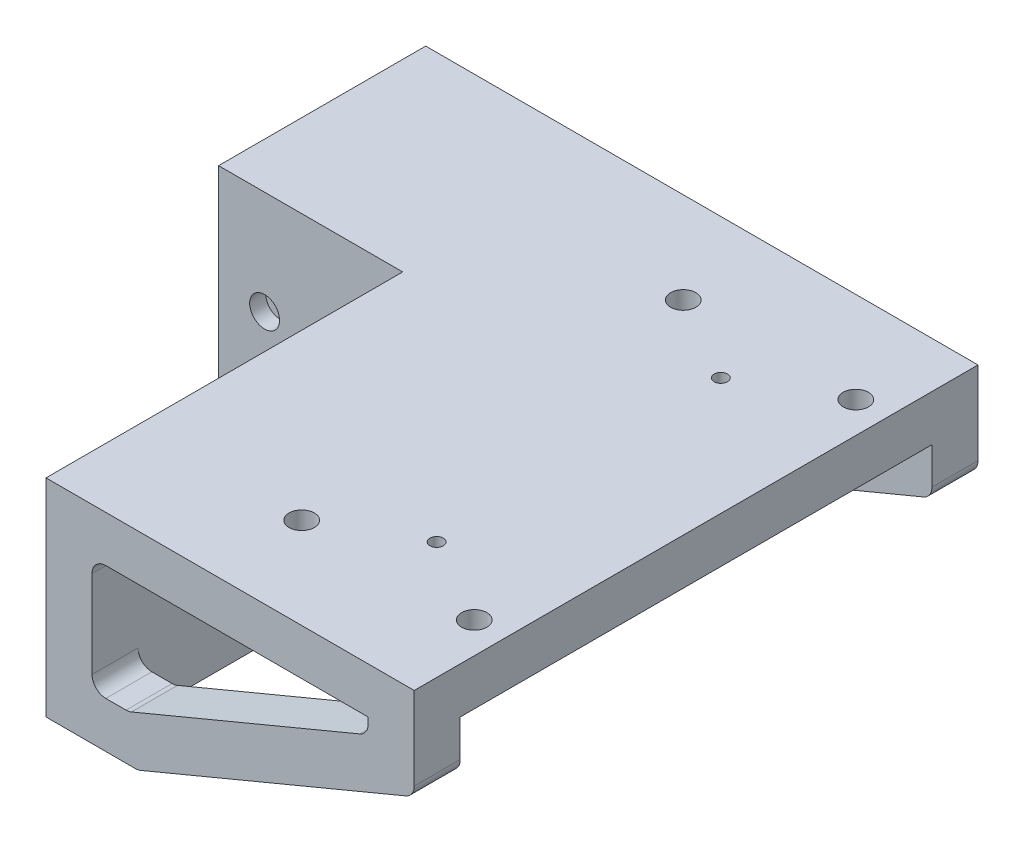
from build123d import *

# Parameters (mm, degrees)
SKETCH1_W                                = 45
SKETCH1_H                                = 45
BOSS_EXTRUDE1_DEPTH                      = 40
CUT_EXTRUDE1_DEPTH                       = 40
CBORE_FOR_M3_SHCS1_D                     = 3.4
CBORE_FOR_M3_SHCS1_CBORE_D               = 6.5
CBORE_FOR_M3_SHCS1_CBORE_DEPTH           = 3.5
CBORE_FOR_M3_SHCS1_ON_FACE_2_D           = 3.4
CBORE_FOR_M3_SHCS1_ON_FACE_2_CBORE_D     = 6.5
CBORE_FOR_M3_SHCS1_ON_FACE_2_CBORE_DEPTH = 3.5
BOSS_EXTRUDE2_DEPTH                      = 100
BOSS_EXTRUDE2_DEPTH_BACK                 = 22.5
CUT_EXTRUDE3_REACH                       = 159.817
SKETCH7_W                                = 102.5
SKETCH7_H                                = 35
M3_5X0_6_TAPPED_HOLE1_D                  = 2.9
M3_5X0_6_TAPPED_HOLE1_DEPTH              = 10
M3_5X0_6_TAPPED_HOLE1_TIP                = 0.871247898
CBORE_FOR_M5_SHCS2_D                     = 5.5
CBORE_FOR_M5_SHCS2_DEPTH                 = 10
CBORE_FOR_M5_SHCS2_CBORE_D               = 10
CBORE_FOR_M5_SHCS2_CBORE_DEPTH           = 6
CBORE_FOR_M5_SHCS2_TIP                   = 1.652366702
FILLET5_R                                = 3


with BuildPart() as part:
    # Sketch1 → Boss-Extrude1 (new body)
    with BuildSketch(Plane(origin=(0, 0, 0), x_dir=(0, 0, -1), z_dir=(1, 0, 0))):
        Rectangle(SKETCH1_W, SKETCH1_H)
    extrude(amount=BOSS_EXTRUDE1_DEPTH)

    # Sketch1_3 → Cut-Extrude1 (cut)
    with BuildSketch(Plane(origin=(0, 0, 0), x_dir=(0, 0, -1), z_dir=(1, 0, 0))):
        with BuildLine():
            Line((12.247448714, 12.5), (12.247448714, -12.5))
            ThreePointArc((12.247448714, -12.5), (0, -17.5), (-12.247448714, -12.5))
            Line((-12.247448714, -12.5), (-12.247448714, 12.5))
            ThreePointArc((-12.247448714, 12.5), (0, 17.5), (12.247448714, 12.5))
        make_face()
    extrude(amount=CUT_EXTRUDE1_DEPTH, mode=Mode.SUBTRACT)

    # CBORE for M3 SHCS1 (through all)
    with Locations(Plane(origin=(10, 0, 22.5), x_dir=(1, 0, 0), z_dir=(0, 0, 1))):
        with Locations((0, 0), (15, 0)):
            CounterBoreHole(CBORE_FOR_M3_SHCS1_D / 2, CBORE_FOR_M3_SHCS1_CBORE_D / 2, CBORE_FOR_M3_SHCS1_CBORE_DEPTH)

    # CBORE for M3 SHCS1 on face 2 (through all)
    with Locations(Plane(origin=(10, 0, -22.5), x_dir=(-1, 0, 0), z_dir=(0, 0, -1))):
        with Locations((0, 0), (-15, 0)):
            CounterBoreHole(CBORE_FOR_M3_SHCS1_ON_FACE_2_D / 2, CBORE_FOR_M3_SHCS1_ON_FACE_2_CBORE_D / 2, CBORE_FOR_M3_SHCS1_ON_FACE_2_CBORE_DEPTH)

    # Sketch2 → Boss-Extrude2 (add, two sides: drawn at the far end of the back side and taken through both)
    with BuildSketch(Plane.XY.offset(-BOSS_EXTRUDE2_DEPTH_BACK)):
        Polygon((40, 22.5), (120, 22.5), (120, 2.5), (60, -22.5), (40, -22.5), align=None)
        Polygon((50, 12.5), (110, 12.5), (110, 9.166666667), (58, -12.5), (50, -12.5), align=None, mode=Mode.SUBTRACT)
    extrude(amount=BOSS_EXTRUDE2_DEPTH + BOSS_EXTRUDE2_DEPTH_BACK)

    # Cut-Extrude3: up to this face of the body (flat: up to its plane)
    cut_extrude3_end = Plane(part.part.faces().sort_by_distance((50, 0, 38.75))[0])
    # Sketch7 → Cut-Extrude3 (cut, up to the picked face)
    with BuildSketch(Plane(origin=(120, 0, 0), x_dir=(0, 0, -1), z_dir=(1, 0, 0)), mode=Mode.PRIVATE) as cut_extrude3_sk1:
        with Locations((-38.75, -5)):
            Rectangle(SKETCH7_W, SKETCH7_H)
    cut_extrude3_tool1 = split(extrude(cut_extrude3_sk1.sketch, amount=-CUT_EXTRUDE3_REACH, mode=Mode.PRIVATE), bisect_by=cut_extrude3_end, keep=Keep.BOTH, mode=Mode.PRIVATE)
    add(cut_extrude3_tool1.solids().sort_by(Axis((120, -5, 38.75), (-1, 0, 0)))[0], mode=Mode.SUBTRACT)

    # M3.5x0.6 Tapped Hole1
    with Locations(Plane(origin=(0, 22.5, 0), x_dir=(1, 0, 0), z_dir=(0, 1, 0))):
        with Locations((94.5, -7.875), (94.5, -69.625)):
            Hole(M3_5X0_6_TAPPED_HOLE1_D / 2, depth=M3_5X0_6_TAPPED_HOLE1_DEPTH)
            with Locations((0, 0, -(M3_5X0_6_TAPPED_HOLE1_DEPTH + M3_5X0_6_TAPPED_HOLE1_TIP / 2))):  # 118° drill point
                Cone(0, M3_5X0_6_TAPPED_HOLE1_D / 2, M3_5X0_6_TAPPED_HOLE1_TIP, mode=Mode.SUBTRACT)

    # CBORE for M5 SHCS2
    with Locations(Plane(origin=(0, 12.5, 0), x_dir=(-1, 0, 0), z_dir=(0, -1, 0))):
        with Locations((-113.25, 2.7), (-75.75, 2.7), (-113.25, -80.2), (-75.75, -80.2)):
            CounterBoreHole(CBORE_FOR_M5_SHCS2_D / 2, CBORE_FOR_M5_SHCS2_CBORE_D / 2, CBORE_FOR_M5_SHCS2_CBORE_DEPTH, depth=CBORE_FOR_M5_SHCS2_DEPTH)
            with Locations((0, 0, -(CBORE_FOR_M5_SHCS2_DEPTH + CBORE_FOR_M5_SHCS2_TIP / 2))):  # 118° drill point
                Cone(0, CBORE_FOR_M5_SHCS2_D / 2, CBORE_FOR_M5_SHCS2_TIP, mode=Mode.SUBTRACT)

    # Fillet5
    fillet5_edges = [part.edges().sort_by_distance(p)[0] for p in [
        (60, -22.5, 95),
        (60, -22.5, -17.5),
        (120, 2.5, -17.5),
        (50, -12.5, -17.5),
        (58, -12.5, -17.5),
        (110, 9.166666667, -17.5),
        (50, 12.5, 38.75),
        (50, -12.5, 95),
        (110, 9.166666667, 95),
        (58, -12.5, 95),
        (120, 2.5, 95),
    ]]
    fillet(fillet5_edges, radius=FILLET5_R)


solid = part.part
